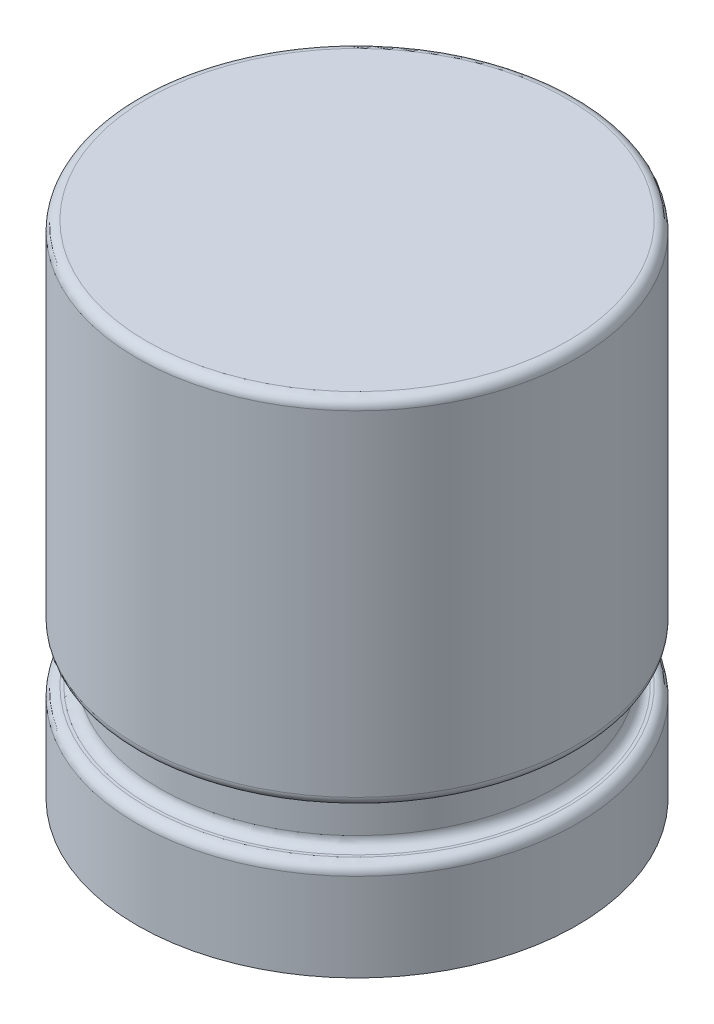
ISO-10303-21;
HEADER;
FILE_DESCRIPTION(('STEP AP214'),'2;1');
FILE_NAME('part.step','',(''),(''),'','','');
FILE_SCHEMA(('AUTOMOTIVE_DESIGN { 1 0 10303 214 1 1 1 1 }'));
ENDSEC;
DATA;
#1=APPLICATION_CONTEXT('core data for automotive mechanical design processes');
#2=APPLICATION_PROTOCOL_DEFINITION('international standard','automotive_design',2000,#1);
#3=PRODUCT_CONTEXT('',#1,'mechanical');
#4=PRODUCT('Part','Part','',(#3));
#5=PRODUCT_RELATED_PRODUCT_CATEGORY('part','',(#4));
#6=PRODUCT_DEFINITION_FORMATION('','',#4);
#7=PRODUCT_DEFINITION_CONTEXT('part definition',#1,'design');
#8=PRODUCT_DEFINITION('design','',#6,#7);
#9=PRODUCT_DEFINITION_SHAPE('','',#8);
#10=(LENGTH_UNIT() NAMED_UNIT(*) SI_UNIT(.MILLI.,.METRE.));
#11=(NAMED_UNIT(*) PLANE_ANGLE_UNIT() SI_UNIT($,.RADIAN.));
#12=(NAMED_UNIT(*) SI_UNIT($,.STERADIAN.) SOLID_ANGLE_UNIT());
#13=UNCERTAINTY_MEASURE_WITH_UNIT(LENGTH_MEASURE(1.E-05),#10,'distance_accuracy_value','');
#14=(GEOMETRIC_REPRESENTATION_CONTEXT(3) GLOBAL_UNCERTAINTY_ASSIGNED_CONTEXT((#13)) GLOBAL_UNIT_ASSIGNED_CONTEXT((#10,
#11,#12)) REPRESENTATION_CONTEXT('',''));
#15=CARTESIAN_POINT('',(0.,0.,0.));
#16=DIRECTION('',(0.,0.,1.));
#17=DIRECTION('',(1.,0.,0.));
#18=AXIS2_PLACEMENT_3D('',#15,#16,#17);
#19=CARTESIAN_POINT('',(0.,0.8,0.));
#20=DIRECTION('',(0.,1.,0.));
#21=DIRECTION('',(0.,0.,1.));
#22=AXIS2_PLACEMENT_3D('',#19,#20,#21);
#23=PLANE('',#22);
#24=CARTESIAN_POINT('',(0.,0.8,0.));
#25=DIRECTION('',(0.,1.,0.));
#26=DIRECTION('',(0.,0.,1.));
#27=AXIS2_PLACEMENT_3D('',#24,#25,#26);
#28=CIRCLE('',#27,1.72);
#29=CARTESIAN_POINT('',(0.,0.8,1.72));
#30=VERTEX_POINT('',#29);
#31=EDGE_CURVE('E62',#30,#30,#28,.T.);
#32=ORIENTED_EDGE('',*,*,#31,.T.);
#33=EDGE_LOOP('',(#32));
#34=FACE_BOUND('',#33,.T.);
#35=CARTESIAN_POINT('',(0.,0.8,0.));
#36=DIRECTION('',(0.,1.,0.));
#37=DIRECTION('',(0.,0.,1.));
#38=AXIS2_PLACEMENT_3D('',#35,#36,#37);
#39=CIRCLE('',#38,1.69731040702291);
#40=CARTESIAN_POINT('',(0.,0.8,1.69731040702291));
#41=VERTEX_POINT('',#40);
#42=EDGE_CURVE('E65',#41,#41,#39,.F.);
#43=ORIENTED_EDGE('',*,*,#42,.T.);
#44=EDGE_LOOP('',(#43));
#45=FACE_BOUND('',#44,.T.);
#46=ADVANCED_FACE('F30',(#34,#45),#23,.T.);
#47=CARTESIAN_POINT('',(0.,0.8,0.));
#48=DIRECTION('',(0.,-1.,0.));
#49=DIRECTION('',(0.,0.,-1.));
#50=AXIS2_PLACEMENT_3D('',#47,#48,#49);
#51=CYLINDRICAL_SURFACE('',#50,1.8);
#52=CARTESIAN_POINT('',(0.,0.72,0.));
#53=DIRECTION('',(0.,1.,0.));
#54=DIRECTION('',(0.,0.,1.));
#55=AXIS2_PLACEMENT_3D('',#52,#53,#54);
#56=CIRCLE('',#55,1.8);
#57=CARTESIAN_POINT('',(0.,0.72,1.8));
#58=VERTEX_POINT('',#57);
#59=EDGE_CURVE('E59',#58,#58,#56,.F.);
#60=ORIENTED_EDGE('',*,*,#59,.T.);
#61=EDGE_LOOP('',(#60));
#62=FACE_BOUND('',#61,.T.);
#63=CARTESIAN_POINT('',(0.,0.,0.));
#64=DIRECTION('',(0.,1.,0.));
#65=DIRECTION('',(0.,0.,1.));
#66=AXIS2_PLACEMENT_3D('',#63,#64,#65);
#67=CIRCLE('',#66,1.8);
#68=CARTESIAN_POINT('',(0.,0.,1.8));
#69=VERTEX_POINT('',#68);
#70=EDGE_CURVE('E68',#69,#69,#67,.T.);
#71=ORIENTED_EDGE('',*,*,#70,.T.);
#72=EDGE_LOOP('',(#71));
#73=FACE_BOUND('',#72,.T.);
#74=ADVANCED_FACE('F72',(#62,#73),#51,.T.);
#75=CARTESIAN_POINT('',(0.,0.,0.));
#76=DIRECTION('',(0.,1.,0.));
#77=DIRECTION('',(0.,0.,1.));
#78=AXIS2_PLACEMENT_3D('',#75,#76,#77);
#79=PLANE('',#78);
#80=ORIENTED_EDGE('',*,*,#70,.F.);
#81=EDGE_LOOP('',(#80));
#82=FACE_BOUND('',#81,.T.);
#83=ADVANCED_FACE('F74',(#82),#79,.F.);
#84=CARTESIAN_POINT('',(0.,1.2,0.));
#85=DIRECTION('',(0.,-1.,0.));
#86=DIRECTION('',(0.,0.,-1.));
#87=AXIS2_PLACEMENT_3D('',#84,#85,#86);
#88=CYLINDRICAL_SURFACE('',#87,1.61731040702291);
#89=CARTESIAN_POINT('',(0.,0.88,0.));
#90=DIRECTION('',(0.,1.,0.));
#91=DIRECTION('',(0.,0.,1.));
#92=AXIS2_PLACEMENT_3D('',#89,#90,#91);
#93=CIRCLE('',#92,1.61731040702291);
#94=CARTESIAN_POINT('',(0.,0.88,1.61731040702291));
#95=VERTEX_POINT('',#94);
#96=EDGE_CURVE('E53',#95,#95,#93,.T.);
#97=ORIENTED_EDGE('',*,*,#96,.T.);
#98=EDGE_LOOP('',(#97));
#99=FACE_BOUND('',#98,.T.);
#100=CARTESIAN_POINT('',(0.,1.12,0.));
#101=DIRECTION('',(0.,1.,0.));
#102=DIRECTION('',(0.,0.,1.));
#103=AXIS2_PLACEMENT_3D('',#100,#101,#102);
#104=CIRCLE('',#103,1.61731040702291);
#105=CARTESIAN_POINT('',(0.,1.12,1.61731040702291));
#106=VERTEX_POINT('',#105);
#107=EDGE_CURVE('E56',#106,#106,#104,.F.);
#108=ORIENTED_EDGE('',*,*,#107,.T.);
#109=EDGE_LOOP('',(#108));
#110=FACE_BOUND('',#109,.T.);
#111=ADVANCED_FACE('F76',(#99,#110),#88,.T.);
#112=CARTESIAN_POINT('',(0.,1.2,0.));
#113=DIRECTION('',(0.,1.,0.));
#114=DIRECTION('',(0.,0.,1.));
#115=AXIS2_PLACEMENT_3D('',#112,#113,#114);
#116=PLANE('',#115);
#117=CARTESIAN_POINT('',(0.,1.2,0.));
#118=DIRECTION('',(0.,1.,0.));
#119=DIRECTION('',(0.,0.,1.));
#120=AXIS2_PLACEMENT_3D('',#117,#118,#119);
#121=CIRCLE('',#120,1.72);
#122=CARTESIAN_POINT('',(0.,1.2,1.72));
#123=VERTEX_POINT('',#122);
#124=EDGE_CURVE('E41',#123,#123,#121,.F.);
#125=ORIENTED_EDGE('',*,*,#124,.T.);
#126=EDGE_LOOP('',(#125));
#127=FACE_BOUND('',#126,.T.);
#128=CARTESIAN_POINT('',(0.,1.2,0.));
#129=DIRECTION('',(0.,1.,0.));
#130=DIRECTION('',(0.,0.,1.));
#131=AXIS2_PLACEMENT_3D('',#128,#129,#130);
#132=CIRCLE('',#131,1.69731040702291);
#133=CARTESIAN_POINT('',(0.,1.2,1.69731040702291));
#134=VERTEX_POINT('',#133);
#135=EDGE_CURVE('E45',#134,#134,#132,.T.);
#136=ORIENTED_EDGE('',*,*,#135,.T.);
#137=EDGE_LOOP('',(#136));
#138=FACE_BOUND('',#137,.T.);
#139=ADVANCED_FACE('F82',(#127,#138),#116,.F.);
#140=CARTESIAN_POINT('',(0.,4.1,0.));
#141=DIRECTION('',(0.,-1.,0.));
#142=DIRECTION('',(0.,0.,-1.));
#143=AXIS2_PLACEMENT_3D('',#140,#141,#142);
#144=CYLINDRICAL_SURFACE('',#143,1.8);
#145=CARTESIAN_POINT('',(0.,4.02,0.));
#146=DIRECTION('',(0.,1.,0.));
#147=DIRECTION('',(0.,0.,1.));
#148=AXIS2_PLACEMENT_3D('',#145,#146,#147);
#149=CIRCLE('',#148,1.8);
#150=CARTESIAN_POINT('',(0.,4.02,1.8));
#151=VERTEX_POINT('',#150);
#152=EDGE_CURVE('E10',#151,#151,#149,.F.);
#153=ORIENTED_EDGE('',*,*,#152,.T.);
#154=EDGE_LOOP('',(#153));
#155=FACE_BOUND('',#154,.T.);
#156=CARTESIAN_POINT('',(0.,1.28,0.));
#157=DIRECTION('',(0.,1.,0.));
#158=DIRECTION('',(0.,0.,1.));
#159=AXIS2_PLACEMENT_3D('',#156,#157,#158);
#160=CIRCLE('',#159,1.8);
#161=CARTESIAN_POINT('',(0.,1.28,1.8));
#162=VERTEX_POINT('',#161);
#163=EDGE_CURVE('E50',#162,#162,#160,.T.);
#164=ORIENTED_EDGE('',*,*,#163,.T.);
#165=EDGE_LOOP('',(#164));
#166=FACE_BOUND('',#165,.T.);
#167=ADVANCED_FACE('F94',(#155,#166),#144,.T.);
#168=CARTESIAN_POINT('',(0.,4.1,0.));
#169=DIRECTION('',(0.,1.,0.));
#170=DIRECTION('',(0.,0.,1.));
#171=AXIS2_PLACEMENT_3D('',#168,#169,#170);
#172=PLANE('',#171);
#173=CARTESIAN_POINT('',(0.,4.1,0.));
#174=DIRECTION('',(0.,1.,0.));
#175=DIRECTION('',(0.,0.,1.));
#176=AXIS2_PLACEMENT_3D('',#173,#174,#175);
#177=CIRCLE('',#176,1.72);
#178=CARTESIAN_POINT('',(0.,4.1,1.72));
#179=VERTEX_POINT('',#178);
#180=EDGE_CURVE('E37',#179,#179,#177,.T.);
#181=ORIENTED_EDGE('',*,*,#180,.T.);
#182=EDGE_LOOP('',(#181));
#183=FACE_BOUND('',#182,.T.);
#184=ADVANCED_FACE('F97',(#183),#172,.T.);
#185=CARTESIAN_POINT('',(0.,0.72,0.));
#186=DIRECTION('',(0.,1.,0.));
#187=DIRECTION('',(0.,0.,1.));
#188=AXIS2_PLACEMENT_3D('',#185,#186,#187);
#189=TOROIDAL_SURFACE('',#188,1.72,0.08);
#190=ORIENTED_EDGE('',*,*,#59,.F.);
#191=EDGE_LOOP('',(#190));
#192=FACE_BOUND('',#191,.T.);
#193=ORIENTED_EDGE('',*,*,#31,.F.);
#194=EDGE_LOOP('',(#193));
#195=FACE_BOUND('',#194,.T.);
#196=ADVANCED_FACE('F102',(#192,#195),#189,.T.);
#197=CARTESIAN_POINT('',(0.,0.88,0.));
#198=DIRECTION('',(0.,1.,0.));
#199=DIRECTION('',(0.,0.,1.));
#200=AXIS2_PLACEMENT_3D('',#197,#198,#199);
#201=TOROIDAL_SURFACE('',#200,1.69731040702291,0.08);
#202=ORIENTED_EDGE('',*,*,#42,.F.);
#203=EDGE_LOOP('',(#202));
#204=FACE_BOUND('',#203,.T.);
#205=ORIENTED_EDGE('',*,*,#96,.F.);
#206=EDGE_LOOP('',(#205));
#207=FACE_BOUND('',#206,.T.);
#208=ADVANCED_FACE('F106',(#204,#207),#201,.F.);
#209=CARTESIAN_POINT('',(0.,1.28,0.));
#210=DIRECTION('',(0.,1.,0.));
#211=DIRECTION('',(0.,0.,1.));
#212=AXIS2_PLACEMENT_3D('',#209,#210,#211);
#213=TOROIDAL_SURFACE('',#212,1.72,0.08);
#214=ORIENTED_EDGE('',*,*,#124,.F.);
#215=EDGE_LOOP('',(#214));
#216=FACE_BOUND('',#215,.T.);
#217=ORIENTED_EDGE('',*,*,#163,.F.);
#218=EDGE_LOOP('',(#217));
#219=FACE_BOUND('',#218,.T.);
#220=ADVANCED_FACE('F112',(#216,#219),#213,.T.);
#221=CARTESIAN_POINT('',(0.,1.12,0.));
#222=DIRECTION('',(0.,1.,0.));
#223=DIRECTION('',(0.,0.,1.));
#224=AXIS2_PLACEMENT_3D('',#221,#222,#223);
#225=TOROIDAL_SURFACE('',#224,1.69731040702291,0.08);
#226=ORIENTED_EDGE('',*,*,#107,.F.);
#227=EDGE_LOOP('',(#226));
#228=FACE_BOUND('',#227,.T.);
#229=ORIENTED_EDGE('',*,*,#135,.F.);
#230=EDGE_LOOP('',(#229));
#231=FACE_BOUND('',#230,.T.);
#232=ADVANCED_FACE('F119',(#228,#231),#225,.F.);
#233=CARTESIAN_POINT('',(0.,4.02,0.));
#234=DIRECTION('',(0.,1.,0.));
#235=DIRECTION('',(0.,0.,1.));
#236=AXIS2_PLACEMENT_3D('',#233,#234,#235);
#237=TOROIDAL_SURFACE('',#236,1.72,0.08);
#238=ORIENTED_EDGE('',*,*,#152,.F.);
#239=EDGE_LOOP('',(#238));
#240=FACE_BOUND('',#239,.T.);
#241=ORIENTED_EDGE('',*,*,#180,.F.);
#242=EDGE_LOOP('',(#241));
#243=FACE_BOUND('',#242,.T.);
#244=ADVANCED_FACE('F32',(#240,#243),#237,.T.);
#245=CLOSED_SHELL('',(#46,#74,#83,#111,#139,#167,#184,#196,#208,#220,#232,#244));
#246=MANIFOLD_SOLID_BREP('B2',#245);
#247=ADVANCED_BREP_SHAPE_REPRESENTATION('',(#18,#246),#14);
#248=SHAPE_DEFINITION_REPRESENTATION(#9,#247);
ENDSEC;
END-ISO-10303-21;
